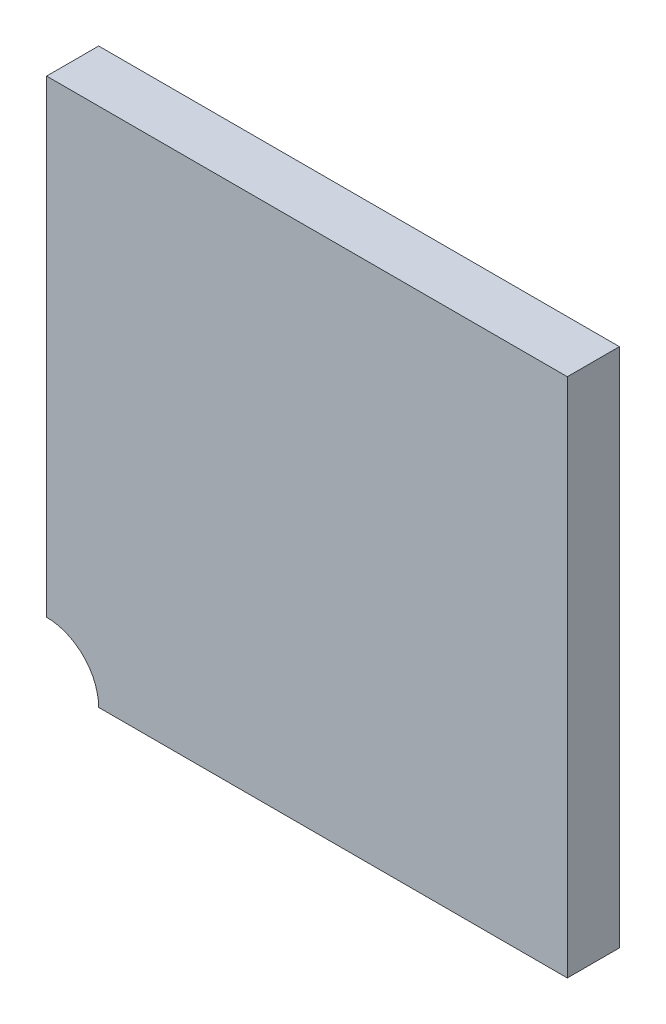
from build123d import *

# Parameters (mm, degrees)
BASE_EXTRUDE_DEPTH = 25.4


with BuildPart() as part:
    # Sketch1 → Base-Extrude (new body)
    with BuildSketch(Plane.XY):
        with BuildLine():
            Line((-25.4, -152.4), (-25.4, 76.2))
            Line((-25.4, 76.2), (228.6, 76.2))
            Line((228.6, 76.2), (228.6, -177.8))
            Line((228.6, -177.8), (0, -177.8))
            ThreePointArc((0, -177.8), (-7.439487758, -159.839487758), (-25.4, -152.4))
        make_face()
    extrude(amount=BASE_EXTRUDE_DEPTH)


solid = part.part
